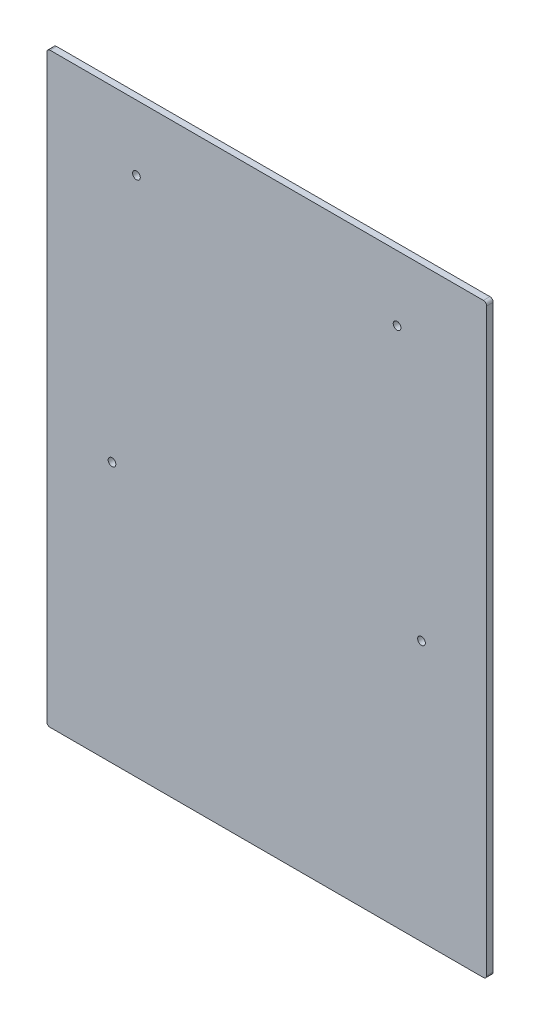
ISO-10303-21;
HEADER;
FILE_DESCRIPTION(('STEP AP214'),'2;1');
FILE_NAME('part.step','',(''),(''),'','','');
FILE_SCHEMA(('AUTOMOTIVE_DESIGN { 1 0 10303 214 1 1 1 1 }'));
ENDSEC;
DATA;
#1=APPLICATION_CONTEXT('core data for automotive mechanical design processes');
#2=APPLICATION_PROTOCOL_DEFINITION('international standard','automotive_design',2000,#1);
#3=PRODUCT_CONTEXT('',#1,'mechanical');
#4=PRODUCT('Part','Part','',(#3));
#5=PRODUCT_RELATED_PRODUCT_CATEGORY('part','',(#4));
#6=PRODUCT_DEFINITION_FORMATION('','',#4);
#7=PRODUCT_DEFINITION_CONTEXT('part definition',#1,'design');
#8=PRODUCT_DEFINITION('design','',#6,#7);
#9=PRODUCT_DEFINITION_SHAPE('','',#8);
#10=(LENGTH_UNIT() NAMED_UNIT(*) SI_UNIT(.MILLI.,.METRE.));
#11=(NAMED_UNIT(*) PLANE_ANGLE_UNIT() SI_UNIT($,.RADIAN.));
#12=(NAMED_UNIT(*) SI_UNIT($,.STERADIAN.) SOLID_ANGLE_UNIT());
#13=UNCERTAINTY_MEASURE_WITH_UNIT(LENGTH_MEASURE(1.E-05),#10,'distance_accuracy_value','');
#14=(GEOMETRIC_REPRESENTATION_CONTEXT(3) GLOBAL_UNCERTAINTY_ASSIGNED_CONTEXT((#13)) GLOBAL_UNIT_ASSIGNED_CONTEXT((#10,
#11,#12)) REPRESENTATION_CONTEXT('',''));
#15=CARTESIAN_POINT('',(0.,0.,0.));
#16=DIRECTION('',(0.,0.,1.));
#17=DIRECTION('',(1.,0.,0.));
#18=AXIS2_PLACEMENT_3D('',#15,#16,#17);
#19=CARTESIAN_POINT('',(171.45,228.6,5.08));
#20=DIRECTION('',(-1.,0.,0.));
#21=DIRECTION('',(0.,-1.,0.));
#22=AXIS2_PLACEMENT_3D('',#19,#20,#21);
#23=PLANE('',#22);
#24=DIRECTION('',(0.,1.,0.));
#25=VECTOR('',#24,1.);
#26=CARTESIAN_POINT('',(171.45,228.6,5.08));
#27=LINE('',#26,#25);
#28=CARTESIAN_POINT('',(171.45,-226.06,5.08));
#29=VERTEX_POINT('',#28);
#30=CARTESIAN_POINT('',(171.45,226.06,5.08));
#31=VERTEX_POINT('',#30);
#32=EDGE_CURVE('E138',#29,#31,#27,.T.);
#33=ORIENTED_EDGE('',*,*,#32,.F.);
#34=DIRECTION('',(0.,0.,-1.));
#35=VECTOR('',#34,1.);
#36=CARTESIAN_POINT('',(171.45,-226.06,5.08));
#37=LINE('',#36,#35);
#38=CARTESIAN_POINT('',(171.45,-226.06,0.));
#39=VERTEX_POINT('',#38);
#40=EDGE_CURVE('E177',#29,#39,#37,.T.);
#41=ORIENTED_EDGE('',*,*,#40,.T.);
#42=DIRECTION('',(0.,1.,0.));
#43=VECTOR('',#42,1.);
#44=CARTESIAN_POINT('',(171.45,228.6,0.));
#45=LINE('',#44,#43);
#46=CARTESIAN_POINT('',(171.45,226.06,0.));
#47=VERTEX_POINT('',#46);
#48=EDGE_CURVE('E188',#39,#47,#45,.T.);
#49=ORIENTED_EDGE('',*,*,#48,.T.);
#50=DIRECTION('',(0.,0.,-1.));
#51=VECTOR('',#50,1.);
#52=CARTESIAN_POINT('',(171.45,226.06,5.08));
#53=LINE('',#52,#51);
#54=EDGE_CURVE('E174',#47,#31,#53,.F.);
#55=ORIENTED_EDGE('',*,*,#54,.T.);
#56=EDGE_LOOP('',(#33,#41,#49,#55));
#57=FACE_BOUND('',#56,.T.);
#58=ADVANCED_FACE('F43',(#57),#23,.F.);
#59=CARTESIAN_POINT('',(-171.45,228.6,5.08));
#60=DIRECTION('',(0.,-1.,0.));
#61=DIRECTION('',(0.,0.,-1.));
#62=AXIS2_PLACEMENT_3D('',#59,#60,#61);
#63=PLANE('',#62);
#64=DIRECTION('',(-1.,0.,0.));
#65=VECTOR('',#64,1.);
#66=CARTESIAN_POINT('',(-171.45,228.6,0.));
#67=LINE('',#66,#65);
#68=CARTESIAN_POINT('',(168.91,228.6,0.));
#69=VERTEX_POINT('',#68);
#70=CARTESIAN_POINT('',(-168.91,228.6,0.));
#71=VERTEX_POINT('',#70);
#72=EDGE_CURVE('E145',#69,#71,#67,.T.);
#73=ORIENTED_EDGE('',*,*,#72,.T.);
#74=DIRECTION('',(0.,0.,-1.));
#75=VECTOR('',#74,1.);
#76=CARTESIAN_POINT('',(-168.91,228.6,5.08));
#77=LINE('',#76,#75);
#78=CARTESIAN_POINT('',(-168.91,228.6,5.08));
#79=VERTEX_POINT('',#78);
#80=EDGE_CURVE('E11',#71,#79,#77,.F.);
#81=ORIENTED_EDGE('',*,*,#80,.T.);
#82=DIRECTION('',(-1.,0.,0.));
#83=VECTOR('',#82,1.);
#84=CARTESIAN_POINT('',(-171.45,228.6,5.08));
#85=LINE('',#84,#83);
#86=CARTESIAN_POINT('',(168.91,228.6,5.08));
#87=VERTEX_POINT('',#86);
#88=EDGE_CURVE('E143',#87,#79,#85,.T.);
#89=ORIENTED_EDGE('',*,*,#88,.F.);
#90=DIRECTION('',(0.,0.,-1.));
#91=VECTOR('',#90,1.);
#92=CARTESIAN_POINT('',(168.91,228.6,5.08));
#93=LINE('',#92,#91);
#94=EDGE_CURVE('E52',#87,#69,#93,.T.);
#95=ORIENTED_EDGE('',*,*,#94,.T.);
#96=EDGE_LOOP('',(#73,#81,#89,#95));
#97=FACE_BOUND('',#96,.T.);
#98=ADVANCED_FACE('F184',(#97),#63,.F.);
#99=CARTESIAN_POINT('',(-171.45,228.6,5.08));
#100=DIRECTION('',(1.,0.,0.));
#101=DIRECTION('',(0.,1.,0.));
#102=AXIS2_PLACEMENT_3D('',#99,#100,#101);
#103=PLANE('',#102);
#104=DIRECTION('',(0.,-1.,0.));
#105=VECTOR('',#104,1.);
#106=CARTESIAN_POINT('',(-171.45,228.6,0.));
#107=LINE('',#106,#105);
#108=CARTESIAN_POINT('',(-171.45,226.06,0.));
#109=VERTEX_POINT('',#108);
#110=CARTESIAN_POINT('',(-171.45,-226.06,0.));
#111=VERTEX_POINT('',#110);
#112=EDGE_CURVE('E139',#109,#111,#107,.T.);
#113=ORIENTED_EDGE('',*,*,#112,.T.);
#114=DIRECTION('',(0.,0.,-1.));
#115=VECTOR('',#114,1.);
#116=CARTESIAN_POINT('',(-171.45,-226.06,5.08));
#117=LINE('',#116,#115);
#118=CARTESIAN_POINT('',(-171.45,-226.06,5.08));
#119=VERTEX_POINT('',#118);
#120=EDGE_CURVE('E114',#111,#119,#117,.F.);
#121=ORIENTED_EDGE('',*,*,#120,.T.);
#122=DIRECTION('',(0.,-1.,0.));
#123=VECTOR('',#122,1.);
#124=CARTESIAN_POINT('',(-171.45,228.6,5.08));
#125=LINE('',#124,#123);
#126=CARTESIAN_POINT('',(-171.45,226.06,5.08));
#127=VERTEX_POINT('',#126);
#128=EDGE_CURVE('E195',#127,#119,#125,.T.);
#129=ORIENTED_EDGE('',*,*,#128,.F.);
#130=DIRECTION('',(0.,0.,-1.));
#131=VECTOR('',#130,1.);
#132=CARTESIAN_POINT('',(-171.45,226.06,5.08));
#133=LINE('',#132,#131);
#134=EDGE_CURVE('E120',#127,#109,#133,.T.);
#135=ORIENTED_EDGE('',*,*,#134,.T.);
#136=EDGE_LOOP('',(#113,#121,#129,#135));
#137=FACE_BOUND('',#136,.T.);
#138=ADVANCED_FACE('F260',(#137),#103,.F.);
#139=CARTESIAN_POINT('',(-171.45,-228.6,5.08));
#140=DIRECTION('',(0.,1.,0.));
#141=DIRECTION('',(0.,0.,1.));
#142=AXIS2_PLACEMENT_3D('',#139,#140,#141);
#143=PLANE('',#142);
#144=DIRECTION('',(1.,0.,0.));
#145=VECTOR('',#144,1.);
#146=CARTESIAN_POINT('',(-171.45,-228.6,5.08));
#147=LINE('',#146,#145);
#148=CARTESIAN_POINT('',(-168.91,-228.6,5.08));
#149=VERTEX_POINT('',#148);
#150=CARTESIAN_POINT('',(168.91,-228.6,5.08));
#151=VERTEX_POINT('',#150);
#152=EDGE_CURVE('E130',#149,#151,#147,.T.);
#153=ORIENTED_EDGE('',*,*,#152,.F.);
#154=DIRECTION('',(0.,0.,-1.));
#155=VECTOR('',#154,1.);
#156=CARTESIAN_POINT('',(-168.91,-228.6,5.08));
#157=LINE('',#156,#155);
#158=CARTESIAN_POINT('',(-168.91,-228.6,0.));
#159=VERTEX_POINT('',#158);
#160=EDGE_CURVE('E113',#149,#159,#157,.T.);
#161=ORIENTED_EDGE('',*,*,#160,.T.);
#162=DIRECTION('',(1.,0.,0.));
#163=VECTOR('',#162,1.);
#164=CARTESIAN_POINT('',(-171.45,-228.6,0.));
#165=LINE('',#164,#163);
#166=CARTESIAN_POINT('',(168.91,-228.6,0.));
#167=VERTEX_POINT('',#166);
#168=EDGE_CURVE('E127',#159,#167,#165,.T.);
#169=ORIENTED_EDGE('',*,*,#168,.T.);
#170=DIRECTION('',(0.,0.,-1.));
#171=VECTOR('',#170,1.);
#172=CARTESIAN_POINT('',(168.91,-228.6,5.08));
#173=LINE('',#172,#171);
#174=EDGE_CURVE('E133',#167,#151,#173,.F.);
#175=ORIENTED_EDGE('',*,*,#174,.T.);
#176=EDGE_LOOP('',(#153,#161,#169,#175));
#177=FACE_BOUND('',#176,.T.);
#178=ADVANCED_FACE('F126',(#177),#143,.F.);
#179=CARTESIAN_POINT('',(0.,0.,5.08));
#180=DIRECTION('',(0.,0.,1.));
#181=DIRECTION('',(1.,0.,0.));
#182=AXIS2_PLACEMENT_3D('',#179,#180,#181);
#183=PLANE('',#182);
#184=CARTESIAN_POINT('',(101.6,177.8,5.08));
#185=DIRECTION('',(0.,0.,-1.));
#186=DIRECTION('',(-1.,0.,0.));
#187=AXIS2_PLACEMENT_3D('',#184,#185,#186);
#188=CIRCLE('',#187,3.00000000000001);
#189=CARTESIAN_POINT('',(98.6,177.8,5.08));
#190=VERTEX_POINT('',#189);
#191=EDGE_CURVE('E225',#190,#190,#188,.T.);
#192=ORIENTED_EDGE('',*,*,#191,.T.);
#193=EDGE_LOOP('',(#192));
#194=FACE_BOUND('',#193,.T.);
#195=CARTESIAN_POINT('',(120.65,-25.4,5.08));
#196=DIRECTION('',(0.,0.,-1.));
#197=DIRECTION('',(-1.,0.,0.));
#198=AXIS2_PLACEMENT_3D('',#195,#196,#197);
#199=CIRCLE('',#198,3.00000000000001);
#200=CARTESIAN_POINT('',(117.65,-25.4,5.08));
#201=VERTEX_POINT('',#200);
#202=EDGE_CURVE('E217',#201,#201,#199,.T.);
#203=ORIENTED_EDGE('',*,*,#202,.T.);
#204=EDGE_LOOP('',(#203));
#205=FACE_BOUND('',#204,.T.);
#206=CARTESIAN_POINT('',(-101.6,177.8,5.08));
#207=DIRECTION('',(0.,0.,1.));
#208=DIRECTION('',(1.,0.,0.));
#209=AXIS2_PLACEMENT_3D('',#206,#207,#208);
#210=CIRCLE('',#209,3.00000000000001);
#211=CARTESIAN_POINT('',(-98.6,177.8,5.08));
#212=VERTEX_POINT('',#211);
#213=EDGE_CURVE('E210',#212,#212,#210,.T.);
#214=ORIENTED_EDGE('',*,*,#213,.F.);
#215=EDGE_LOOP('',(#214));
#216=FACE_BOUND('',#215,.T.);
#217=CARTESIAN_POINT('',(-120.65,-25.4,5.08));
#218=DIRECTION('',(0.,0.,1.));
#219=DIRECTION('',(1.,0.,0.));
#220=AXIS2_PLACEMENT_3D('',#217,#218,#219);
#221=CIRCLE('',#220,3.00000000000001);
#222=CARTESIAN_POINT('',(-117.65,-25.4,5.08));
#223=VERTEX_POINT('',#222);
#224=EDGE_CURVE('E205',#223,#223,#221,.T.);
#225=ORIENTED_EDGE('',*,*,#224,.F.);
#226=EDGE_LOOP('',(#225));
#227=FACE_BOUND('',#226,.T.);
#228=ORIENTED_EDGE('',*,*,#128,.T.);
#229=CARTESIAN_POINT('',(-168.91,-226.06,5.08));
#230=DIRECTION('',(0.,0.,1.));
#231=DIRECTION('',(1.,0.,0.));
#232=AXIS2_PLACEMENT_3D('',#229,#230,#231);
#233=CIRCLE('',#232,2.54);
#234=EDGE_CURVE('E171',#119,#149,#233,.T.);
#235=ORIENTED_EDGE('',*,*,#234,.T.);
#236=ORIENTED_EDGE('',*,*,#152,.T.);
#237=CARTESIAN_POINT('',(168.91,-226.06,5.08));
#238=DIRECTION('',(0.,0.,1.));
#239=DIRECTION('',(1.,0.,0.));
#240=AXIS2_PLACEMENT_3D('',#237,#238,#239);
#241=CIRCLE('',#240,2.54);
#242=EDGE_CURVE('E168',#151,#29,#241,.T.);
#243=ORIENTED_EDGE('',*,*,#242,.T.);
#244=ORIENTED_EDGE('',*,*,#32,.T.);
#245=CARTESIAN_POINT('',(168.91,226.06,5.08));
#246=DIRECTION('',(0.,0.,1.));
#247=DIRECTION('',(1.,0.,0.));
#248=AXIS2_PLACEMENT_3D('',#245,#246,#247);
#249=CIRCLE('',#248,2.54);
#250=EDGE_CURVE('E64',#31,#87,#249,.T.);
#251=ORIENTED_EDGE('',*,*,#250,.T.);
#252=ORIENTED_EDGE('',*,*,#88,.T.);
#253=CARTESIAN_POINT('',(-168.91,226.06,5.08));
#254=DIRECTION('',(0.,0.,1.));
#255=DIRECTION('',(1.,0.,0.));
#256=AXIS2_PLACEMENT_3D('',#253,#254,#255);
#257=CIRCLE('',#256,2.54);
#258=EDGE_CURVE('E165',#79,#127,#257,.T.);
#259=ORIENTED_EDGE('',*,*,#258,.T.);
#260=EDGE_LOOP('',(#228,#235,#236,#243,#244,#251,#252,#259));
#261=FACE_BOUND('',#260,.T.);
#262=ADVANCED_FACE('F238',(#194,#205,#216,#227,#261),#183,.T.);
#263=CARTESIAN_POINT('',(0.,0.,0.));
#264=DIRECTION('',(0.,0.,1.));
#265=DIRECTION('',(1.,0.,0.));
#266=AXIS2_PLACEMENT_3D('',#263,#264,#265);
#267=PLANE('',#266);
#268=CARTESIAN_POINT('',(101.6,177.8,0.));
#269=DIRECTION('',(0.,0.,-1.));
#270=DIRECTION('',(-1.,0.,0.));
#271=AXIS2_PLACEMENT_3D('',#268,#269,#270);
#272=CIRCLE('',#271,3.00000000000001);
#273=CARTESIAN_POINT('',(98.6,177.8,0.));
#274=VERTEX_POINT('',#273);
#275=EDGE_CURVE('E206',#274,#274,#272,.T.);
#276=ORIENTED_EDGE('',*,*,#275,.F.);
#277=EDGE_LOOP('',(#276));
#278=FACE_BOUND('',#277,.T.);
#279=CARTESIAN_POINT('',(120.65,-25.4,0.));
#280=DIRECTION('',(0.,0.,-1.));
#281=DIRECTION('',(-1.,0.,0.));
#282=AXIS2_PLACEMENT_3D('',#279,#280,#281);
#283=CIRCLE('',#282,3.00000000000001);
#284=CARTESIAN_POINT('',(117.65,-25.4,0.));
#285=VERTEX_POINT('',#284);
#286=EDGE_CURVE('E221',#285,#285,#283,.T.);
#287=ORIENTED_EDGE('',*,*,#286,.F.);
#288=EDGE_LOOP('',(#287));
#289=FACE_BOUND('',#288,.T.);
#290=CARTESIAN_POINT('',(-101.6,177.8,0.));
#291=DIRECTION('',(0.,0.,1.));
#292=DIRECTION('',(1.,0.,0.));
#293=AXIS2_PLACEMENT_3D('',#290,#291,#292);
#294=CIRCLE('',#293,3.00000000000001);
#295=CARTESIAN_POINT('',(-98.6,177.8,0.));
#296=VERTEX_POINT('',#295);
#297=EDGE_CURVE('E190',#296,#296,#294,.T.);
#298=ORIENTED_EDGE('',*,*,#297,.T.);
#299=EDGE_LOOP('',(#298));
#300=FACE_BOUND('',#299,.T.);
#301=CARTESIAN_POINT('',(-120.65,-25.4,0.));
#302=DIRECTION('',(0.,0.,1.));
#303=DIRECTION('',(1.,0.,0.));
#304=AXIS2_PLACEMENT_3D('',#301,#302,#303);
#305=CIRCLE('',#304,3.00000000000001);
#306=CARTESIAN_POINT('',(-117.65,-25.4,0.));
#307=VERTEX_POINT('',#306);
#308=EDGE_CURVE('E201',#307,#307,#305,.T.);
#309=ORIENTED_EDGE('',*,*,#308,.T.);
#310=EDGE_LOOP('',(#309));
#311=FACE_BOUND('',#310,.T.);
#312=ORIENTED_EDGE('',*,*,#168,.F.);
#313=CARTESIAN_POINT('',(-168.91,-226.06,0.));
#314=DIRECTION('',(0.,0.,1.));
#315=DIRECTION('',(1.,0.,0.));
#316=AXIS2_PLACEMENT_3D('',#313,#314,#315);
#317=CIRCLE('',#316,2.54);
#318=EDGE_CURVE('E109',#159,#111,#317,.F.);
#319=ORIENTED_EDGE('',*,*,#318,.T.);
#320=ORIENTED_EDGE('',*,*,#112,.F.);
#321=CARTESIAN_POINT('',(-168.91,226.06,0.));
#322=DIRECTION('',(0.,0.,1.));
#323=DIRECTION('',(1.,0.,0.));
#324=AXIS2_PLACEMENT_3D('',#321,#322,#323);
#325=CIRCLE('',#324,2.54);
#326=EDGE_CURVE('E153',#109,#71,#325,.F.);
#327=ORIENTED_EDGE('',*,*,#326,.T.);
#328=ORIENTED_EDGE('',*,*,#72,.F.);
#329=CARTESIAN_POINT('',(168.91,226.06,0.));
#330=DIRECTION('',(0.,0.,1.));
#331=DIRECTION('',(1.,0.,0.));
#332=AXIS2_PLACEMENT_3D('',#329,#330,#331);
#333=CIRCLE('',#332,2.54);
#334=EDGE_CURVE('E132',#69,#47,#333,.F.);
#335=ORIENTED_EDGE('',*,*,#334,.T.);
#336=ORIENTED_EDGE('',*,*,#48,.F.);
#337=CARTESIAN_POINT('',(168.91,-226.06,0.));
#338=DIRECTION('',(0.,0.,1.));
#339=DIRECTION('',(1.,0.,0.));
#340=AXIS2_PLACEMENT_3D('',#337,#338,#339);
#341=CIRCLE('',#340,2.54);
#342=EDGE_CURVE('E121',#39,#167,#341,.F.);
#343=ORIENTED_EDGE('',*,*,#342,.T.);
#344=EDGE_LOOP('',(#312,#319,#320,#327,#328,#335,#336,#343));
#345=FACE_BOUND('',#344,.T.);
#346=ADVANCED_FACE('F135',(#278,#289,#300,#311,#345),#267,.F.);
#347=CARTESIAN_POINT('',(-168.91,-226.06,5.08));
#348=DIRECTION('',(0.,0.,-1.));
#349=DIRECTION('',(-1.,0.,0.));
#350=AXIS2_PLACEMENT_3D('',#347,#348,#349);
#351=CYLINDRICAL_SURFACE('',#350,2.54);
#352=ORIENTED_EDGE('',*,*,#234,.F.);
#353=ORIENTED_EDGE('',*,*,#120,.F.);
#354=ORIENTED_EDGE('',*,*,#318,.F.);
#355=ORIENTED_EDGE('',*,*,#160,.F.);
#356=EDGE_LOOP('',(#352,#353,#354,#355));
#357=FACE_BOUND('',#356,.T.);
#358=ADVANCED_FACE('F112',(#357),#351,.T.);
#359=CARTESIAN_POINT('',(168.91,-226.06,5.08));
#360=DIRECTION('',(0.,0.,-1.));
#361=DIRECTION('',(-1.,0.,0.));
#362=AXIS2_PLACEMENT_3D('',#359,#360,#361);
#363=CYLINDRICAL_SURFACE('',#362,2.54);
#364=ORIENTED_EDGE('',*,*,#242,.F.);
#365=ORIENTED_EDGE('',*,*,#174,.F.);
#366=ORIENTED_EDGE('',*,*,#342,.F.);
#367=ORIENTED_EDGE('',*,*,#40,.F.);
#368=EDGE_LOOP('',(#364,#365,#366,#367));
#369=FACE_BOUND('',#368,.T.);
#370=ADVANCED_FACE('F264',(#369),#363,.T.);
#371=CARTESIAN_POINT('',(-168.91,226.06,5.08));
#372=DIRECTION('',(0.,0.,-1.));
#373=DIRECTION('',(-1.,0.,0.));
#374=AXIS2_PLACEMENT_3D('',#371,#372,#373);
#375=CYLINDRICAL_SURFACE('',#374,2.54);
#376=ORIENTED_EDGE('',*,*,#258,.F.);
#377=ORIENTED_EDGE('',*,*,#80,.F.);
#378=ORIENTED_EDGE('',*,*,#326,.F.);
#379=ORIENTED_EDGE('',*,*,#134,.F.);
#380=EDGE_LOOP('',(#376,#377,#378,#379));
#381=FACE_BOUND('',#380,.T.);
#382=ADVANCED_FACE('F262',(#381),#375,.T.);
#383=CARTESIAN_POINT('',(168.91,226.06,5.08));
#384=DIRECTION('',(0.,0.,-1.));
#385=DIRECTION('',(-1.,0.,0.));
#386=AXIS2_PLACEMENT_3D('',#383,#384,#385);
#387=CYLINDRICAL_SURFACE('',#386,2.54);
#388=ORIENTED_EDGE('',*,*,#250,.F.);
#389=ORIENTED_EDGE('',*,*,#54,.F.);
#390=ORIENTED_EDGE('',*,*,#334,.F.);
#391=ORIENTED_EDGE('',*,*,#94,.F.);
#392=EDGE_LOOP('',(#388,#389,#390,#391));
#393=FACE_BOUND('',#392,.T.);
#394=ADVANCED_FACE('F45',(#393),#387,.T.);
#395=CARTESIAN_POINT('',(-120.65,-25.4,0.));
#396=DIRECTION('',(0.,0.,1.));
#397=DIRECTION('',(1.,0.,0.));
#398=AXIS2_PLACEMENT_3D('',#395,#396,#397);
#399=CYLINDRICAL_SURFACE('',#398,3.00000000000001);
#400=ORIENTED_EDGE('',*,*,#308,.F.);
#401=EDGE_LOOP('',(#400));
#402=FACE_BOUND('',#401,.T.);
#403=ORIENTED_EDGE('',*,*,#224,.T.);
#404=EDGE_LOOP('',(#403));
#405=FACE_BOUND('',#404,.T.);
#406=ADVANCED_FACE('F246',(#402,#405),#399,.F.);
#407=CARTESIAN_POINT('',(-101.6,177.8,0.));
#408=DIRECTION('',(0.,0.,1.));
#409=DIRECTION('',(1.,0.,0.));
#410=AXIS2_PLACEMENT_3D('',#407,#408,#409);
#411=CYLINDRICAL_SURFACE('',#410,3.00000000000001);
#412=ORIENTED_EDGE('',*,*,#297,.F.);
#413=EDGE_LOOP('',(#412));
#414=FACE_BOUND('',#413,.T.);
#415=ORIENTED_EDGE('',*,*,#213,.T.);
#416=EDGE_LOOP('',(#415));
#417=FACE_BOUND('',#416,.T.);
#418=ADVANCED_FACE('F249',(#414,#417),#411,.F.);
#419=CARTESIAN_POINT('',(120.65,-25.4,0.));
#420=DIRECTION('',(0.,0.,1.));
#421=DIRECTION('',(1.,0.,0.));
#422=AXIS2_PLACEMENT_3D('',#419,#420,#421);
#423=CYLINDRICAL_SURFACE('',#422,3.00000000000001);
#424=ORIENTED_EDGE('',*,*,#286,.T.);
#425=EDGE_LOOP('',(#424));
#426=FACE_BOUND('',#425,.T.);
#427=ORIENTED_EDGE('',*,*,#202,.F.);
#428=EDGE_LOOP('',(#427));
#429=FACE_BOUND('',#428,.T.);
#430=ADVANCED_FACE('F320',(#426,#429),#423,.F.);
#431=CARTESIAN_POINT('',(101.6,177.8,0.));
#432=DIRECTION('',(0.,0.,1.));
#433=DIRECTION('',(1.,0.,0.));
#434=AXIS2_PLACEMENT_3D('',#431,#432,#433);
#435=CYLINDRICAL_SURFACE('',#434,3.00000000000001);
#436=ORIENTED_EDGE('',*,*,#275,.T.);
#437=EDGE_LOOP('',(#436));
#438=FACE_BOUND('',#437,.T.);
#439=ORIENTED_EDGE('',*,*,#191,.F.);
#440=EDGE_LOOP('',(#439));
#441=FACE_BOUND('',#440,.T.);
#442=ADVANCED_FACE('F233',(#438,#441),#435,.F.);
#443=CLOSED_SHELL('',(#58,#98,#138,#178,#262,#346,#358,#370,#382,#394,#406,#418,#430,#442));
#444=MANIFOLD_SOLID_BREP('B2',#443);
#445=ADVANCED_BREP_SHAPE_REPRESENTATION('',(#18,#444),#14);
#446=SHAPE_DEFINITION_REPRESENTATION(#9,#445);
ENDSEC;
END-ISO-10303-21;
